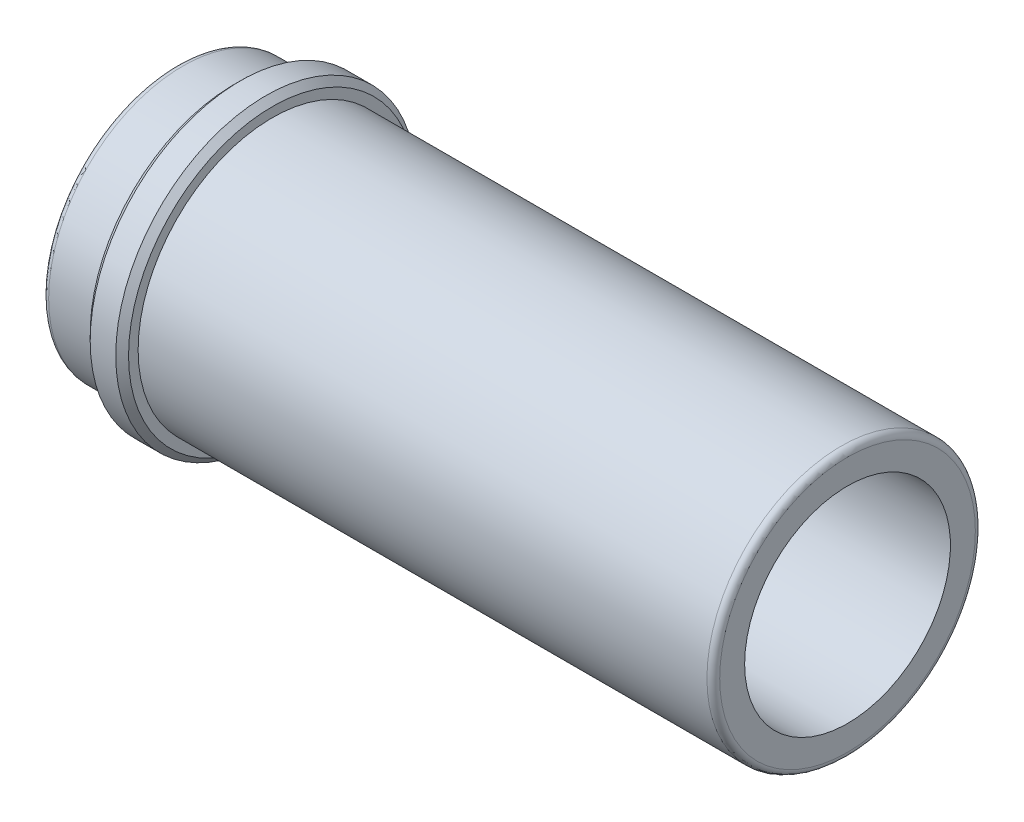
ISO-10303-21;
HEADER;
FILE_DESCRIPTION(('STEP AP214'),'2;1');
FILE_NAME('part.step','',(''),(''),'','','');
FILE_SCHEMA(('AUTOMOTIVE_DESIGN { 1 0 10303 214 1 1 1 1 }'));
ENDSEC;
DATA;
#1=APPLICATION_CONTEXT('core data for automotive mechanical design processes');
#2=APPLICATION_PROTOCOL_DEFINITION('international standard','automotive_design',2000,#1);
#3=PRODUCT_CONTEXT('',#1,'mechanical');
#4=PRODUCT('Part','Part','',(#3));
#5=PRODUCT_RELATED_PRODUCT_CATEGORY('part','',(#4));
#6=PRODUCT_DEFINITION_FORMATION('','',#4);
#7=PRODUCT_DEFINITION_CONTEXT('part definition',#1,'design');
#8=PRODUCT_DEFINITION('design','',#6,#7);
#9=PRODUCT_DEFINITION_SHAPE('','',#8);
#10=(LENGTH_UNIT() NAMED_UNIT(*) SI_UNIT(.MILLI.,.METRE.));
#11=(NAMED_UNIT(*) PLANE_ANGLE_UNIT() SI_UNIT($,.RADIAN.));
#12=(NAMED_UNIT(*) SI_UNIT($,.STERADIAN.) SOLID_ANGLE_UNIT());
#13=UNCERTAINTY_MEASURE_WITH_UNIT(LENGTH_MEASURE(1.E-05),#10,'distance_accuracy_value','');
#14=(GEOMETRIC_REPRESENTATION_CONTEXT(3) GLOBAL_UNCERTAINTY_ASSIGNED_CONTEXT((#13)) GLOBAL_UNIT_ASSIGNED_CONTEXT((#10,
#11,#12)) REPRESENTATION_CONTEXT('',''));
#15=CARTESIAN_POINT('',(0.,0.,0.));
#16=DIRECTION('',(0.,0.,1.));
#17=DIRECTION('',(1.,0.,0.));
#18=AXIS2_PLACEMENT_3D('',#15,#16,#17);
#19=CARTESIAN_POINT('',(9.,21.,0.));
#20=DIRECTION('',(1.,0.,0.));
#21=DIRECTION('',(0.,0.,-1.));
#22=AXIS2_PLACEMENT_3D('',#19,#20,#21);
#23=PLANE('',#22);
#24=CARTESIAN_POINT('',(9.,0.,0.));
#25=DIRECTION('',(1.,0.,0.));
#26=DIRECTION('',(0.,0.,-1.));
#27=AXIS2_PLACEMENT_3D('',#24,#25,#26);
#28=CIRCLE('',#27,22.5);
#29=CARTESIAN_POINT('',(9.,0.,-22.5));
#30=VERTEX_POINT('',#29);
#31=EDGE_CURVE('E9',#30,#30,#28,.F.);
#32=ORIENTED_EDGE('',*,*,#31,.T.);
#33=EDGE_LOOP('',(#32));
#34=FACE_BOUND('',#33,.T.);
#35=CARTESIAN_POINT('',(9.,0.,0.));
#36=DIRECTION('',(-1.,0.,0.));
#37=DIRECTION('',(0.,0.,1.));
#38=AXIS2_PLACEMENT_3D('',#35,#36,#37);
#39=CIRCLE('',#38,21.);
#40=CARTESIAN_POINT('',(9.,0.,21.));
#41=VERTEX_POINT('',#40);
#42=EDGE_CURVE('E55',#41,#41,#39,.T.);
#43=ORIENTED_EDGE('',*,*,#42,.F.);
#44=EDGE_LOOP('',(#43));
#45=FACE_BOUND('',#44,.T.);
#46=ADVANCED_FACE('F14',(#34,#45),#23,.F.);
#47=CARTESIAN_POINT('',(0.,0.,0.));
#48=DIRECTION('',(-1.,0.,0.));
#49=DIRECTION('',(0.,0.,1.));
#50=AXIS2_PLACEMENT_3D('',#47,#48,#49);
#51=CYLINDRICAL_SURFACE('',#50,23.5);
#52=CARTESIAN_POINT('',(14.,0.,0.));
#53=DIRECTION('',(-1.,0.,0.));
#54=DIRECTION('',(0.,0.,1.));
#55=AXIS2_PLACEMENT_3D('',#52,#53,#54);
#56=CIRCLE('',#55,23.5);
#57=CARTESIAN_POINT('',(14.,0.,23.5));
#58=VERTEX_POINT('',#57);
#59=EDGE_CURVE('E25',#58,#58,#56,.T.);
#60=ORIENTED_EDGE('',*,*,#59,.T.);
#61=EDGE_LOOP('',(#60));
#62=FACE_BOUND('',#61,.T.);
#63=CARTESIAN_POINT('',(10.,0.,0.));
#64=DIRECTION('',(1.,0.,0.));
#65=DIRECTION('',(0.,0.,-1.));
#66=AXIS2_PLACEMENT_3D('',#63,#64,#65);
#67=CIRCLE('',#66,23.5);
#68=CARTESIAN_POINT('',(10.,0.,-23.5));
#69=VERTEX_POINT('',#68);
#70=EDGE_CURVE('E29',#69,#69,#67,.T.);
#71=ORIENTED_EDGE('',*,*,#70,.T.);
#72=EDGE_LOOP('',(#71));
#73=FACE_BOUND('',#72,.T.);
#74=ADVANCED_FACE('F62',(#62,#73),#51,.T.);
#75=CARTESIAN_POINT('',(15.,23.5,0.));
#76=DIRECTION('',(-1.,0.,0.));
#77=DIRECTION('',(0.,0.,1.));
#78=AXIS2_PLACEMENT_3D('',#75,#76,#77);
#79=PLANE('',#78);
#80=CARTESIAN_POINT('',(15.,0.,0.));
#81=DIRECTION('',(-1.,0.,0.));
#82=DIRECTION('',(0.,0.,1.));
#83=AXIS2_PLACEMENT_3D('',#80,#81,#82);
#84=CIRCLE('',#83,22.5);
#85=CARTESIAN_POINT('',(15.,0.,22.5));
#86=VERTEX_POINT('',#85);
#87=EDGE_CURVE('E21',#86,#86,#84,.F.);
#88=ORIENTED_EDGE('',*,*,#87,.T.);
#89=EDGE_LOOP('',(#88));
#90=FACE_BOUND('',#89,.T.);
#91=CARTESIAN_POINT('',(15.,0.,0.));
#92=DIRECTION('',(-1.,0.,0.));
#93=DIRECTION('',(0.,0.,1.));
#94=AXIS2_PLACEMENT_3D('',#91,#92,#93);
#95=CIRCLE('',#94,21.);
#96=CARTESIAN_POINT('',(15.,0.,21.));
#97=VERTEX_POINT('',#96);
#98=EDGE_CURVE('E46',#97,#97,#95,.T.);
#99=ORIENTED_EDGE('',*,*,#98,.T.);
#100=EDGE_LOOP('',(#99));
#101=FACE_BOUND('',#100,.T.);
#102=ADVANCED_FACE('F69',(#90,#101),#79,.F.);
#103=CARTESIAN_POINT('',(0.,0.,0.));
#104=DIRECTION('',(-1.,0.,0.));
#105=DIRECTION('',(0.,0.,1.));
#106=AXIS2_PLACEMENT_3D('',#103,#104,#105);
#107=CYLINDRICAL_SURFACE('',#106,21.);
#108=CARTESIAN_POINT('',(104.,0.,0.));
#109=DIRECTION('',(-1.,0.,0.));
#110=DIRECTION('',(0.,0.,1.));
#111=AXIS2_PLACEMENT_3D('',#108,#109,#110);
#112=CIRCLE('',#111,21.);
#113=CARTESIAN_POINT('',(104.,0.,21.));
#114=VERTEX_POINT('',#113);
#115=EDGE_CURVE('E43',#114,#114,#112,.T.);
#116=ORIENTED_EDGE('',*,*,#115,.T.);
#117=EDGE_LOOP('',(#116));
#118=FACE_BOUND('',#117,.T.);
#119=ORIENTED_EDGE('',*,*,#98,.F.);
#120=EDGE_LOOP('',(#119));
#121=FACE_BOUND('',#120,.T.);
#122=ADVANCED_FACE('F114',(#118,#121),#107,.T.);
#123=CARTESIAN_POINT('',(105.,21.,0.));
#124=DIRECTION('',(-1.,0.,0.));
#125=DIRECTION('',(0.,0.,1.));
#126=AXIS2_PLACEMENT_3D('',#123,#124,#125);
#127=PLANE('',#126);
#128=CARTESIAN_POINT('',(105.,0.,0.));
#129=DIRECTION('',(-1.,0.,0.));
#130=DIRECTION('',(0.,0.,1.));
#131=AXIS2_PLACEMENT_3D('',#128,#129,#130);
#132=CIRCLE('',#131,20.);
#133=CARTESIAN_POINT('',(105.,0.,20.));
#134=VERTEX_POINT('',#133);
#135=EDGE_CURVE('E40',#134,#134,#132,.F.);
#136=ORIENTED_EDGE('',*,*,#135,.T.);
#137=EDGE_LOOP('',(#136));
#138=FACE_BOUND('',#137,.T.);
#139=CARTESIAN_POINT('',(105.,0.,0.));
#140=DIRECTION('',(-1.,0.,0.));
#141=DIRECTION('',(0.,0.,1.));
#142=AXIS2_PLACEMENT_3D('',#139,#140,#141);
#143=CIRCLE('',#142,16.1);
#144=CARTESIAN_POINT('',(105.,0.,16.1));
#145=VERTEX_POINT('',#144);
#146=EDGE_CURVE('E49',#145,#145,#143,.T.);
#147=ORIENTED_EDGE('',*,*,#146,.T.);
#148=EDGE_LOOP('',(#147));
#149=FACE_BOUND('',#148,.T.);
#150=ADVANCED_FACE('F144',(#138,#149),#127,.F.);
#151=CARTESIAN_POINT('',(0.,0.,0.));
#152=DIRECTION('',(-1.,0.,0.));
#153=DIRECTION('',(0.,0.,1.));
#154=AXIS2_PLACEMENT_3D('',#151,#152,#153);
#155=CYLINDRICAL_SURFACE('',#154,16.1);
#156=ORIENTED_EDGE('',*,*,#146,.F.);
#157=EDGE_LOOP('',(#156));
#158=FACE_BOUND('',#157,.T.);
#159=CARTESIAN_POINT('',(0.,0.,0.));
#160=DIRECTION('',(-1.,0.,0.));
#161=DIRECTION('',(0.,0.,1.));
#162=AXIS2_PLACEMENT_3D('',#159,#160,#161);
#163=CIRCLE('',#162,16.1);
#164=CARTESIAN_POINT('',(0.,0.,16.1));
#165=VERTEX_POINT('',#164);
#166=EDGE_CURVE('E52',#165,#165,#163,.T.);
#167=ORIENTED_EDGE('',*,*,#166,.T.);
#168=EDGE_LOOP('',(#167));
#169=FACE_BOUND('',#168,.T.);
#170=ADVANCED_FACE('F136',(#158,#169),#155,.F.);
#171=CARTESIAN_POINT('',(0.,16.1,0.));
#172=DIRECTION('',(1.,0.,0.));
#173=DIRECTION('',(0.,0.,-1.));
#174=AXIS2_PLACEMENT_3D('',#171,#172,#173);
#175=PLANE('',#174);
#176=CARTESIAN_POINT('',(0.,0.,0.));
#177=DIRECTION('',(1.,0.,0.));
#178=DIRECTION('',(0.,0.,-1.));
#179=AXIS2_PLACEMENT_3D('',#176,#177,#178);
#180=CIRCLE('',#179,20.);
#181=CARTESIAN_POINT('',(0.,0.,-20.));
#182=VERTEX_POINT('',#181);
#183=EDGE_CURVE('E37',#182,#182,#180,.F.);
#184=ORIENTED_EDGE('',*,*,#183,.T.);
#185=EDGE_LOOP('',(#184));
#186=FACE_BOUND('',#185,.T.);
#187=ORIENTED_EDGE('',*,*,#166,.F.);
#188=EDGE_LOOP('',(#187));
#189=FACE_BOUND('',#188,.T.);
#190=ADVANCED_FACE('F125',(#186,#189),#175,.F.);
#191=CARTESIAN_POINT('',(0.,0.,0.));
#192=DIRECTION('',(-1.,0.,0.));
#193=DIRECTION('',(0.,0.,1.));
#194=AXIS2_PLACEMENT_3D('',#191,#192,#193);
#195=CYLINDRICAL_SURFACE('',#194,21.);
#196=CARTESIAN_POINT('',(1.,0.,0.));
#197=DIRECTION('',(1.,0.,0.));
#198=DIRECTION('',(0.,0.,-1.));
#199=AXIS2_PLACEMENT_3D('',#196,#197,#198);
#200=CIRCLE('',#199,21.);
#201=CARTESIAN_POINT('',(1.,0.,-21.));
#202=VERTEX_POINT('',#201);
#203=EDGE_CURVE('E34',#202,#202,#200,.T.);
#204=ORIENTED_EDGE('',*,*,#203,.T.);
#205=EDGE_LOOP('',(#204));
#206=FACE_BOUND('',#205,.T.);
#207=ORIENTED_EDGE('',*,*,#42,.T.);
#208=EDGE_LOOP('',(#207));
#209=FACE_BOUND('',#208,.T.);
#210=ADVANCED_FACE('F59',(#206,#209),#195,.T.);
#211=CARTESIAN_POINT('',(104.,0.,0.));
#212=DIRECTION('',(-1.,0.,0.));
#213=DIRECTION('',(0.,0.,1.));
#214=AXIS2_PLACEMENT_3D('',#211,#212,#213);
#215=TOROIDAL_SURFACE('',#214,20.,1.);
#216=ORIENTED_EDGE('',*,*,#135,.F.);
#217=EDGE_LOOP('',(#216));
#218=FACE_BOUND('',#217,.T.);
#219=ORIENTED_EDGE('',*,*,#115,.F.);
#220=EDGE_LOOP('',(#219));
#221=FACE_BOUND('',#220,.T.);
#222=ADVANCED_FACE('F74',(#218,#221),#215,.T.);
#223=CARTESIAN_POINT('',(1.,0.,0.));
#224=DIRECTION('',(1.,0.,0.));
#225=DIRECTION('',(0.,0.,-1.));
#226=AXIS2_PLACEMENT_3D('',#223,#224,#225);
#227=TOROIDAL_SURFACE('',#226,20.,1.);
#228=ORIENTED_EDGE('',*,*,#203,.F.);
#229=EDGE_LOOP('',(#228));
#230=FACE_BOUND('',#229,.T.);
#231=ORIENTED_EDGE('',*,*,#183,.F.);
#232=EDGE_LOOP('',(#231));
#233=FACE_BOUND('',#232,.T.);
#234=ADVANCED_FACE('F77',(#230,#233),#227,.T.);
#235=CARTESIAN_POINT('',(14.,0.,0.));
#236=DIRECTION('',(-1.,0.,0.));
#237=DIRECTION('',(0.,0.,1.));
#238=AXIS2_PLACEMENT_3D('',#235,#236,#237);
#239=CONICAL_SURFACE('',#238,23.5,0.785398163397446);
#240=ORIENTED_EDGE('',*,*,#87,.F.);
#241=EDGE_LOOP('',(#240));
#242=FACE_BOUND('',#241,.T.);
#243=ORIENTED_EDGE('',*,*,#59,.F.);
#244=EDGE_LOOP('',(#243));
#245=FACE_BOUND('',#244,.T.);
#246=ADVANCED_FACE('F80',(#242,#245),#239,.T.);
#247=CARTESIAN_POINT('',(9.,0.,0.));
#248=DIRECTION('',(1.,0.,0.));
#249=DIRECTION('',(0.,0.,-1.));
#250=AXIS2_PLACEMENT_3D('',#247,#248,#249);
#251=CONICAL_SURFACE('',#250,22.5,0.785398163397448);
#252=ORIENTED_EDGE('',*,*,#70,.F.);
#253=EDGE_LOOP('',(#252));
#254=FACE_BOUND('',#253,.T.);
#255=ORIENTED_EDGE('',*,*,#31,.F.);
#256=EDGE_LOOP('',(#255));
#257=FACE_BOUND('',#256,.T.);
#258=ADVANCED_FACE('F16',(#254,#257),#251,.T.);
#259=CLOSED_SHELL('',(#46,#74,#102,#122,#150,#170,#190,#210,#222,#234,#246,#258));
#260=MANIFOLD_SOLID_BREP('B1',#259);
#261=ADVANCED_BREP_SHAPE_REPRESENTATION('',(#18,#260),#14);
#262=SHAPE_DEFINITION_REPRESENTATION(#9,#261);
ENDSEC;
END-ISO-10303-21;
